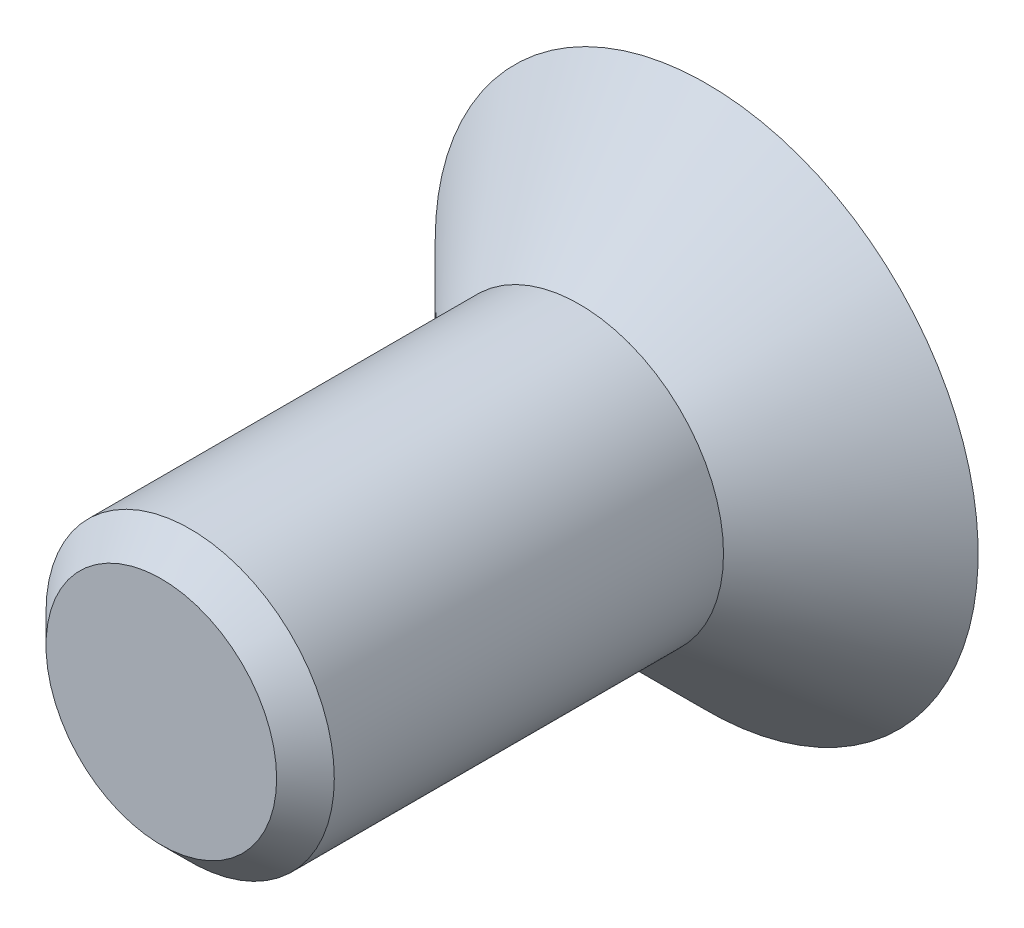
ISO-10303-21;
HEADER;
FILE_DESCRIPTION(('STEP AP214'),'2;1');
FILE_NAME('part.step','',(''),(''),'','','');
FILE_SCHEMA(('AUTOMOTIVE_DESIGN { 1 0 10303 214 1 1 1 1 }'));
ENDSEC;
DATA;
#1=APPLICATION_CONTEXT('core data for automotive mechanical design processes');
#2=APPLICATION_PROTOCOL_DEFINITION('international standard','automotive_design',2000,#1);
#3=PRODUCT_CONTEXT('',#1,'mechanical');
#4=PRODUCT('Part','Part','',(#3));
#5=PRODUCT_RELATED_PRODUCT_CATEGORY('part','',(#4));
#6=PRODUCT_DEFINITION_FORMATION('','',#4);
#7=PRODUCT_DEFINITION_CONTEXT('part definition',#1,'design');
#8=PRODUCT_DEFINITION('design','',#6,#7);
#9=PRODUCT_DEFINITION_SHAPE('','',#8);
#10=(LENGTH_UNIT() NAMED_UNIT(*) SI_UNIT(.MILLI.,.METRE.));
#11=(NAMED_UNIT(*) PLANE_ANGLE_UNIT() SI_UNIT($,.RADIAN.));
#12=(NAMED_UNIT(*) SI_UNIT($,.STERADIAN.) SOLID_ANGLE_UNIT());
#13=UNCERTAINTY_MEASURE_WITH_UNIT(LENGTH_MEASURE(1.E-05),#10,'distance_accuracy_value','');
#14=(GEOMETRIC_REPRESENTATION_CONTEXT(3) GLOBAL_UNCERTAINTY_ASSIGNED_CONTEXT((#13)) GLOBAL_UNIT_ASSIGNED_CONTEXT((#10,
#11,#12)) REPRESENTATION_CONTEXT('',''));
#15=CARTESIAN_POINT('',(0.,0.,0.));
#16=DIRECTION('',(0.,0.,1.));
#17=DIRECTION('',(1.,0.,0.));
#18=AXIS2_PLACEMENT_3D('',#15,#16,#17);
#19=CARTESIAN_POINT('',(0.,0.,-2.64999999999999));
#20=DIRECTION('',(0.,0.,1.));
#21=DIRECTION('',(1.,0.,0.));
#22=AXIS2_PLACEMENT_3D('',#19,#20,#21);
#23=PLANE('',#22);
#24=CARTESIAN_POINT('',(0.,0.,-2.64999999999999));
#25=DIRECTION('',(0.,0.,-1.));
#26=DIRECTION('',(-1.,0.,0.));
#27=AXIS2_PLACEMENT_3D('',#24,#25,#26);
#28=CIRCLE('',#27,5.65);
#29=CARTESIAN_POINT('',(-5.65,0.,-2.64999999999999));
#30=VERTEX_POINT('',#29);
#31=EDGE_CURVE('E94',#30,#30,#28,.T.);
#32=ORIENTED_EDGE('',*,*,#31,.T.);
#33=EDGE_LOOP('',(#32));
#34=FACE_BOUND('',#33,.T.);
#35=DIRECTION('',(-0.86602540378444,0.499999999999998,0.));
#36=VECTOR('',#35,1.);
#37=CARTESIAN_POINT('',(0.,2.30940107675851,-2.64999999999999));
#38=LINE('',#37,#36);
#39=CARTESIAN_POINT('',(2.,1.15470053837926,-2.64999999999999));
#40=VERTEX_POINT('',#39);
#41=CARTESIAN_POINT('',(0.,2.30940107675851,-2.64999999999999));
#42=VERTEX_POINT('',#41);
#43=EDGE_CURVE('E51',#40,#42,#38,.T.);
#44=ORIENTED_EDGE('',*,*,#43,.T.);
#45=DIRECTION('',(-0.866025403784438,-0.500000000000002,0.));
#46=VECTOR('',#45,1.);
#47=CARTESIAN_POINT('',(-2.,1.15470053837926,-2.64999999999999));
#48=LINE('',#47,#46);
#49=CARTESIAN_POINT('',(-2.,1.15470053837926,-2.64999999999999));
#50=VERTEX_POINT('',#49);
#51=EDGE_CURVE('E151',#42,#50,#48,.T.);
#52=ORIENTED_EDGE('',*,*,#51,.T.);
#53=DIRECTION('',(0.,-1.,0.));
#54=VECTOR('',#53,1.);
#55=CARTESIAN_POINT('',(-2.,-1.15470053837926,-2.64999999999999));
#56=LINE('',#55,#54);
#57=CARTESIAN_POINT('',(-2.,-1.15470053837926,-2.64999999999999));
#58=VERTEX_POINT('',#57);
#59=EDGE_CURVE('E154',#50,#58,#56,.T.);
#60=ORIENTED_EDGE('',*,*,#59,.T.);
#61=DIRECTION('',(0.866025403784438,-0.500000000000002,0.));
#62=VECTOR('',#61,1.);
#63=CARTESIAN_POINT('',(-2.,-1.15470053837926,-2.64999999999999));
#64=LINE('',#63,#62);
#65=CARTESIAN_POINT('',(0.,-2.30940107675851,-2.64999999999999));
#66=VERTEX_POINT('',#65);
#67=EDGE_CURVE('E160',#58,#66,#64,.T.);
#68=ORIENTED_EDGE('',*,*,#67,.T.);
#69=DIRECTION('',(0.86602540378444,0.499999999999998,0.));
#70=VECTOR('',#69,1.);
#71=CARTESIAN_POINT('',(0.,-2.30940107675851,-2.64999999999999));
#72=LINE('',#71,#70);
#73=CARTESIAN_POINT('',(2.,-1.15470053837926,-2.64999999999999));
#74=VERTEX_POINT('',#73);
#75=EDGE_CURVE('E163',#66,#74,#72,.T.);
#76=ORIENTED_EDGE('',*,*,#75,.T.);
#77=DIRECTION('',(0.,1.,0.));
#78=VECTOR('',#77,1.);
#79=CARTESIAN_POINT('',(2.,-1.15470053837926,-2.64999999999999));
#80=LINE('',#79,#78);
#81=EDGE_CURVE('E100',#74,#40,#80,.T.);
#82=ORIENTED_EDGE('',*,*,#81,.T.);
#83=EDGE_LOOP('',(#44,#52,#60,#68,#76,#82));
#84=FACE_BOUND('',#83,.T.);
#85=ADVANCED_FACE('F37',(#34,#84),#23,.F.);
#86=CARTESIAN_POINT('',(0.,0.,0.));
#87=DIRECTION('',(0.,0.,-1.));
#88=DIRECTION('',(-1.,0.,0.));
#89=AXIS2_PLACEMENT_3D('',#86,#87,#88);
#90=CONICAL_SURFACE('',#89,3.,0.78539816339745);
#91=ORIENTED_EDGE('',*,*,#31,.F.);
#92=EDGE_LOOP('',(#91));
#93=FACE_BOUND('',#92,.T.);
#94=CARTESIAN_POINT('',(0.,0.,0.));
#95=DIRECTION('',(0.,0.,1.));
#96=DIRECTION('',(1.,0.,0.));
#97=AXIS2_PLACEMENT_3D('',#94,#95,#96);
#98=CIRCLE('',#97,3.);
#99=CARTESIAN_POINT('',(3.,0.,0.));
#100=VERTEX_POINT('',#99);
#101=EDGE_CURVE('E152',#100,#100,#98,.T.);
#102=ORIENTED_EDGE('',*,*,#101,.F.);
#103=EDGE_LOOP('',(#102));
#104=FACE_BOUND('',#103,.T.);
#105=ADVANCED_FACE('F138',(#93,#104),#90,.T.);
#106=CARTESIAN_POINT('',(0.,2.30940107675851,0.15000000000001));
#107=DIRECTION('',(-0.499999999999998,-0.86602540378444,0.));
#108=DIRECTION('',(0.86602540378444,-0.499999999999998,0.));
#109=AXIS2_PLACEMENT_3D('',#106,#107,#108);
#110=PLANE('',#109);
#111=DIRECTION('',(-0.86602540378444,0.499999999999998,0.));
#112=VECTOR('',#111,1.);
#113=CARTESIAN_POINT('',(0.999999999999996,1.73205080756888,0.));
#114=LINE('',#113,#112);
#115=CARTESIAN_POINT('',(2.,1.15470053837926,0.));
#116=VERTEX_POINT('',#115);
#117=CARTESIAN_POINT('',(0.,2.30940107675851,0.));
#118=VERTEX_POINT('',#117);
#119=EDGE_CURVE('E59',#116,#118,#114,.T.);
#120=ORIENTED_EDGE('',*,*,#119,.T.);
#121=DIRECTION('',(0.,0.,-1.));
#122=VECTOR('',#121,1.);
#123=CARTESIAN_POINT('',(0.,2.30940107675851,0.15000000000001));
#124=LINE('',#123,#122);
#125=EDGE_CURVE('E172',#118,#42,#124,.T.);
#126=ORIENTED_EDGE('',*,*,#125,.T.);
#127=ORIENTED_EDGE('',*,*,#43,.F.);
#128=DIRECTION('',(0.,0.,-1.));
#129=VECTOR('',#128,1.);
#130=CARTESIAN_POINT('',(2.,1.15470053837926,0.15000000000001));
#131=LINE('',#130,#129);
#132=EDGE_CURVE('E105',#116,#40,#131,.T.);
#133=ORIENTED_EDGE('',*,*,#132,.F.);
#134=EDGE_LOOP('',(#120,#126,#127,#133));
#135=FACE_BOUND('',#134,.T.);
#136=ADVANCED_FACE('F143',(#135),#110,.T.);
#137=CARTESIAN_POINT('',(-2.,1.15470053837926,0.15000000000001));
#138=DIRECTION('',(0.500000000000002,-0.866025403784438,0.));
#139=DIRECTION('',(0.866025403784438,0.500000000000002,0.));
#140=AXIS2_PLACEMENT_3D('',#137,#138,#139);
#141=PLANE('',#140);
#142=DIRECTION('',(-0.866025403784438,-0.500000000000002,0.));
#143=VECTOR('',#142,1.);
#144=CARTESIAN_POINT('',(-1.00000000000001,1.73205080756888,0.));
#145=LINE('',#144,#143);
#146=CARTESIAN_POINT('',(-2.,1.15470053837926,0.));
#147=VERTEX_POINT('',#146);
#148=EDGE_CURVE('E117',#118,#147,#145,.T.);
#149=ORIENTED_EDGE('',*,*,#148,.T.);
#150=DIRECTION('',(0.,0.,-1.));
#151=VECTOR('',#150,1.);
#152=CARTESIAN_POINT('',(-2.,1.15470053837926,0.15000000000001));
#153=LINE('',#152,#151);
#154=EDGE_CURVE('E170',#147,#50,#153,.T.);
#155=ORIENTED_EDGE('',*,*,#154,.T.);
#156=ORIENTED_EDGE('',*,*,#51,.F.);
#157=ORIENTED_EDGE('',*,*,#125,.F.);
#158=EDGE_LOOP('',(#149,#155,#156,#157));
#159=FACE_BOUND('',#158,.T.);
#160=ADVANCED_FACE('F231',(#159),#141,.T.);
#161=CARTESIAN_POINT('',(-2.,-1.15470053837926,0.15000000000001));
#162=DIRECTION('',(1.,0.,0.));
#163=DIRECTION('',(0.,0.,-1.));
#164=AXIS2_PLACEMENT_3D('',#161,#162,#163);
#165=PLANE('',#164);
#166=DIRECTION('',(0.,-1.,0.));
#167=VECTOR('',#166,1.);
#168=CARTESIAN_POINT('',(-2.,0.,0.));
#169=LINE('',#168,#167);
#170=CARTESIAN_POINT('',(-2.,-1.15470053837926,0.));
#171=VERTEX_POINT('',#170);
#172=EDGE_CURVE('E111',#147,#171,#169,.T.);
#173=ORIENTED_EDGE('',*,*,#172,.T.);
#174=DIRECTION('',(0.,0.,-1.));
#175=VECTOR('',#174,1.);
#176=CARTESIAN_POINT('',(-2.,-1.15470053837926,0.15000000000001));
#177=LINE('',#176,#175);
#178=EDGE_CURVE('E168',#171,#58,#177,.T.);
#179=ORIENTED_EDGE('',*,*,#178,.T.);
#180=ORIENTED_EDGE('',*,*,#59,.F.);
#181=ORIENTED_EDGE('',*,*,#154,.F.);
#182=EDGE_LOOP('',(#173,#179,#180,#181));
#183=FACE_BOUND('',#182,.T.);
#184=ADVANCED_FACE('F223',(#183),#165,.T.);
#185=CARTESIAN_POINT('',(-2.,-1.15470053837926,0.15000000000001));
#186=DIRECTION('',(0.500000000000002,0.866025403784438,0.));
#187=DIRECTION('',(-0.866025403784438,0.500000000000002,0.));
#188=AXIS2_PLACEMENT_3D('',#185,#186,#187);
#189=PLANE('',#188);
#190=DIRECTION('',(0.866025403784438,-0.500000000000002,0.));
#191=VECTOR('',#190,1.);
#192=CARTESIAN_POINT('',(-1.00000000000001,-1.73205080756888,0.));
#193=LINE('',#192,#191);
#194=CARTESIAN_POINT('',(0.,-2.30940107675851,0.));
#195=VERTEX_POINT('',#194);
#196=EDGE_CURVE('E109',#171,#195,#193,.T.);
#197=ORIENTED_EDGE('',*,*,#196,.T.);
#198=DIRECTION('',(0.,0.,-1.));
#199=VECTOR('',#198,1.);
#200=CARTESIAN_POINT('',(0.,-2.30940107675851,0.15000000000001));
#201=LINE('',#200,#199);
#202=EDGE_CURVE('E104',#195,#66,#201,.T.);
#203=ORIENTED_EDGE('',*,*,#202,.T.);
#204=ORIENTED_EDGE('',*,*,#67,.F.);
#205=ORIENTED_EDGE('',*,*,#178,.F.);
#206=EDGE_LOOP('',(#197,#203,#204,#205));
#207=FACE_BOUND('',#206,.T.);
#208=ADVANCED_FACE('F216',(#207),#189,.T.);
#209=CARTESIAN_POINT('',(0.,-2.30940107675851,0.15000000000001));
#210=DIRECTION('',(-0.499999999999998,0.86602540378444,0.));
#211=DIRECTION('',(-0.86602540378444,-0.499999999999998,0.));
#212=AXIS2_PLACEMENT_3D('',#209,#210,#211);
#213=PLANE('',#212);
#214=DIRECTION('',(0.86602540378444,0.499999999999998,0.));
#215=VECTOR('',#214,1.);
#216=CARTESIAN_POINT('',(0.999999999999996,-1.73205080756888,0.));
#217=LINE('',#216,#215);
#218=CARTESIAN_POINT('',(2.,-1.15470053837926,0.));
#219=VERTEX_POINT('',#218);
#220=EDGE_CURVE('E91',#195,#219,#217,.T.);
#221=ORIENTED_EDGE('',*,*,#220,.T.);
#222=DIRECTION('',(0.,0.,-1.));
#223=VECTOR('',#222,1.);
#224=CARTESIAN_POINT('',(2.,-1.15470053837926,0.15000000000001));
#225=LINE('',#224,#223);
#226=EDGE_CURVE('E97',#219,#74,#225,.T.);
#227=ORIENTED_EDGE('',*,*,#226,.T.);
#228=ORIENTED_EDGE('',*,*,#75,.F.);
#229=ORIENTED_EDGE('',*,*,#202,.F.);
#230=EDGE_LOOP('',(#221,#227,#228,#229));
#231=FACE_BOUND('',#230,.T.);
#232=ADVANCED_FACE('F108',(#231),#213,.T.);
#233=CARTESIAN_POINT('',(2.,-1.15470053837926,0.15000000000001));
#234=DIRECTION('',(-1.,0.,0.));
#235=DIRECTION('',(0.,0.,1.));
#236=AXIS2_PLACEMENT_3D('',#233,#234,#235);
#237=PLANE('',#236);
#238=DIRECTION('',(0.,1.,0.));
#239=VECTOR('',#238,1.);
#240=CARTESIAN_POINT('',(2.,0.,0.));
#241=LINE('',#240,#239);
#242=EDGE_CURVE('E87',#219,#116,#241,.T.);
#243=ORIENTED_EDGE('',*,*,#242,.T.);
#244=ORIENTED_EDGE('',*,*,#132,.T.);
#245=ORIENTED_EDGE('',*,*,#81,.F.);
#246=ORIENTED_EDGE('',*,*,#226,.F.);
#247=EDGE_LOOP('',(#243,#244,#245,#246));
#248=FACE_BOUND('',#247,.T.);
#249=ADVANCED_FACE('F98',(#248),#237,.T.);
#250=CARTESIAN_POINT('',(0.,0.,0.));
#251=DIRECTION('',(0.,0.,-1.));
#252=DIRECTION('',(-1.,0.,0.));
#253=AXIS2_PLACEMENT_3D('',#250,#251,#252);
#254=PLANE('',#253);
#255=ORIENTED_EDGE('',*,*,#148,.F.);
#256=ORIENTED_EDGE('',*,*,#119,.F.);
#257=ORIENTED_EDGE('',*,*,#242,.F.);
#258=ORIENTED_EDGE('',*,*,#220,.F.);
#259=ORIENTED_EDGE('',*,*,#196,.F.);
#260=ORIENTED_EDGE('',*,*,#172,.F.);
#261=EDGE_LOOP('',(#255,#256,#257,#258,#259,#260));
#262=FACE_BOUND('',#261,.T.);
#263=ADVANCED_FACE('F89',(#262),#254,.T.);
#264=CARTESIAN_POINT('',(0.,0.,8.7));
#265=DIRECTION('',(0.,0.,1.));
#266=DIRECTION('',(1.,0.,0.));
#267=AXIS2_PLACEMENT_3D('',#264,#265,#266);
#268=PLANE('',#267);
#269=CARTESIAN_POINT('',(0.,0.,8.7));
#270=DIRECTION('',(0.,0.,1.));
#271=DIRECTION('',(1.,0.,0.));
#272=AXIS2_PLACEMENT_3D('',#269,#270,#271);
#273=CIRCLE('',#272,2.4);
#274=CARTESIAN_POINT('',(2.4,0.,8.7));
#275=VERTEX_POINT('',#274);
#276=EDGE_CURVE('E44',#275,#275,#273,.T.);
#277=ORIENTED_EDGE('',*,*,#276,.T.);
#278=EDGE_LOOP('',(#277));
#279=FACE_BOUND('',#278,.T.);
#280=ADVANCED_FACE('F123',(#279),#268,.T.);
#281=CARTESIAN_POINT('',(0.,0.,0.));
#282=DIRECTION('',(0.,0.,1.));
#283=DIRECTION('',(1.,0.,0.));
#284=AXIS2_PLACEMENT_3D('',#281,#282,#283);
#285=CYLINDRICAL_SURFACE('',#284,3.);
#286=CARTESIAN_POINT('',(0.,0.,8.1));
#287=DIRECTION('',(0.,0.,1.));
#288=DIRECTION('',(1.,0.,0.));
#289=AXIS2_PLACEMENT_3D('',#286,#287,#288);
#290=CIRCLE('',#289,3.);
#291=CARTESIAN_POINT('',(3.,0.,8.1));
#292=VERTEX_POINT('',#291);
#293=EDGE_CURVE('E11',#292,#292,#290,.F.);
#294=ORIENTED_EDGE('',*,*,#293,.T.);
#295=EDGE_LOOP('',(#294));
#296=FACE_BOUND('',#295,.T.);
#297=ORIENTED_EDGE('',*,*,#101,.T.);
#298=EDGE_LOOP('',(#297));
#299=FACE_BOUND('',#298,.T.);
#300=ADVANCED_FACE('F127',(#296,#299),#285,.T.);
#301=CARTESIAN_POINT('',(0.,0.,8.7));
#302=DIRECTION('',(0.,0.,-1.));
#303=DIRECTION('',(-1.,0.,0.));
#304=AXIS2_PLACEMENT_3D('',#301,#302,#303);
#305=CONICAL_SURFACE('',#304,2.4,0.785398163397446);
#306=ORIENTED_EDGE('',*,*,#293,.F.);
#307=EDGE_LOOP('',(#306));
#308=FACE_BOUND('',#307,.T.);
#309=ORIENTED_EDGE('',*,*,#276,.F.);
#310=EDGE_LOOP('',(#309));
#311=FACE_BOUND('',#310,.T.);
#312=ADVANCED_FACE('F125',(#308,#311),#305,.T.);
#313=CLOSED_SHELL('',(#85,#105,#136,#160,#184,#208,#232,#249,#263,#280,#300,#312));
#314=MANIFOLD_SOLID_BREP('B2',#313);
#315=ADVANCED_BREP_SHAPE_REPRESENTATION('',(#18,#314),#14);
#316=SHAPE_DEFINITION_REPRESENTATION(#9,#315);
ENDSEC;
END-ISO-10303-21;
